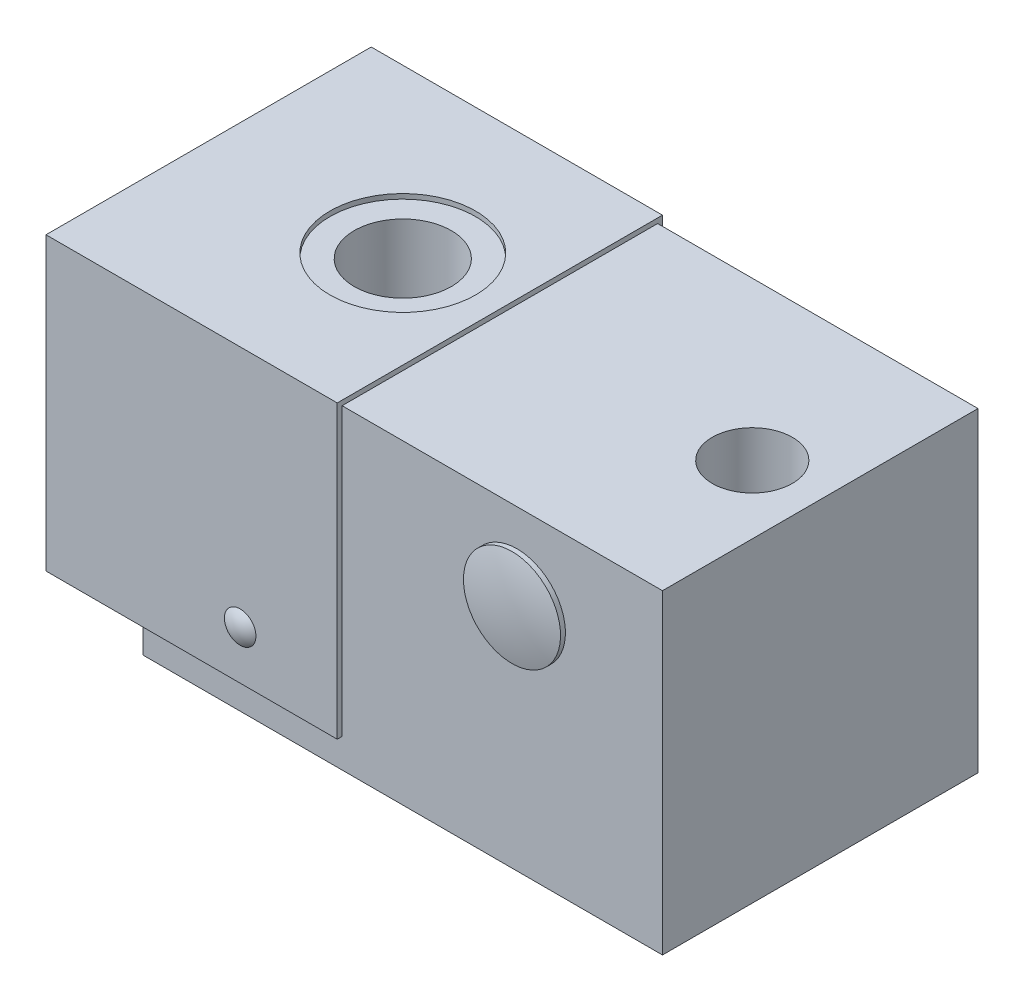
from build123d import *
from build123d.topology import SkipClean

# Parameters (mm, degrees)
EXTRUDE1_DEPTH           = 66
CUT_EXTRUDE1_DEPTH       = 32.5
CUT_EXTRUDE1_DEPTH_BACK  = 32.5
SKETCH2_W                = 66
SKETCH2_H                = 2
CUT_EXTRUDE2_DEPTH       = 32.5
CUT_EXTRUDE2_DEPTH_BACK  = 32.5
SKETCH3_W                = 30
SKETCH3_H                = 65
SKETCH4_W                = 2
SKETCH4_H                = 6
CUT_EXTRUDE3_DEPTH       = 60
SKETCH5_W                = 2
SKETCH5_H                = 6
CUT_EXTRUDE4_DEPTH       = 60
SKETCH7_W                = 8.25
SKETCH7_H                = 65
CUT_EXTRUDE5_DEPTH       = 5
REVOLVE3_ANGLE           = 90
REVOLVE3_OTHER_WAY_ANGLE = 90
REVOLVE4_ANGLE           = 90
REVOLVE4_OTHER_WAY_ANGLE = 90
SKETCH20_R               = 4.55
CUT_EXTRUDE6_DEPTH       = 4.5
CUT_EXTRUDE7_DEPTH       = 5


with BuildPart() as part:
    # Sketch1 → Extrude1 (new body)
    with BuildSketch(Plane(origin=(0, 0, 0), x_dir=(-1, 0, 0), z_dir=(0, 1, 0))):
        Polygon((60, 33.5), (0, 33.5), (0, 32.5), (-66, 32.5), (-66, -32.5), (0, -32.5), (0, -33.5), (60, -33.5), align=None)
    extrude(amount=EXTRUDE1_DEPTH)

    # Sketch2 → Cut-Extrude1 (cut, two sides: drawn at the far end of the back side and taken through both)
    with BuildSketch(Plane.XY.offset(-CUT_EXTRUDE1_DEPTH_BACK)):
        with Locations((33, 66)):
            Rectangle(SKETCH2_W, SKETCH2_H)
    extrude(amount=CUT_EXTRUDE1_DEPTH + CUT_EXTRUDE1_DEPTH_BACK, mode=Mode.SUBTRACT)

    # Sketch3 → Cut-Extrude2 (cut, two sides: drawn at the far end of the back side and taken through both)
    with BuildSketch(Plane.XY.offset(-CUT_EXTRUDE2_DEPTH_BACK)):
        with Locations((-56, 32.5)):
            Rectangle(SKETCH3_W, SKETCH3_H)
    extrude(amount=CUT_EXTRUDE2_DEPTH + CUT_EXTRUDE2_DEPTH_BACK, mode=Mode.SUBTRACT)

    # Sketch4 → Cut-Extrude3 (cut)
    with BuildSketch(Plane(origin=(0, 0, 0), x_dir=(0, 0, -1), z_dir=(1, 0, 0))):
        with Locations((-33.5, 3)):
            Rectangle(SKETCH4_W, SKETCH4_H)
    extrude(amount=-CUT_EXTRUDE3_DEPTH, mode=Mode.SUBTRACT)

    # Sketch5 → Cut-Extrude4 (cut)
    with BuildSketch(Plane(origin=(0, 0, 0), x_dir=(0, 0, -1), z_dir=(1, 0, 0))):
        with Locations((33.5, 3)):
            Rectangle(SKETCH5_W, SKETCH5_H)
    extrude(amount=-CUT_EXTRUDE4_DEPTH, mode=Mode.SUBTRACT)

    # Sketch6 → Cut-Revolve1 (revolve, cut)
    with BuildSketch(Plane.XY, mode=Mode.PRIVATE) as cut_revolve1_sk:
        Polygon((-64.75, 32.5), (-64.75, 50.5), (10, 50.5), (10, 48.75), (33, 48.75), (40.577499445, 32.5), align=None)
    revolve(cut_revolve1_sk.sketch.rotate(Axis((40.577499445, 32.5, 0), (-1, 0, 0)), 270), axis=Axis((40.577499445, 32.5, 0), (-1, 0, 0)), mode=Mode.SUBTRACT)

    # Sketch7 → Cut-Revolve2 (revolve, cut)
    with BuildSketch(Plane.XY, mode=Mode.PRIVATE) as cut_revolve2_sk:
        with Locations((56.125, 32.5)):
            Rectangle(SKETCH7_W, SKETCH7_H)
    revolve(cut_revolve2_sk.sketch.rotate(Axis((52, 0, 0), (0, 1, 0)), 270), axis=Axis((52, 0, 0), (0, 1, 0)), mode=Mode.SUBTRACT)

    # Sketch8 → Cut-Revolve3 (revolve, cut)
    with BuildSketch(Plane.XY.offset(23.5), mode=Mode.PRIVATE) as cut_revolve3_sk:
        Polygon((52, 21.417942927), (56.188, 19), (56.188, 0.812), (57, 0), (52, 0), align=None)
    revolve(cut_revolve3_sk.sketch.rotate(Axis((52, 0, 23.5), (0, 1, 0)), 270), axis=Axis((52, 0, 23.5), (0, 1, 0)), mode=Mode.SUBTRACT)

    # Sketch9 → Cut-Revolve4 (revolve, cut)
    with BuildSketch(Plane.XY.offset(23.5), mode=Mode.PRIVATE) as cut_revolve4_sk:
        Polygon((-31, 21.417942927), (-26.812, 19), (-26.812, 0.812), (-26, 0), (-31, 0), align=None)
    revolve(cut_revolve4_sk.sketch.rotate(Axis((-31, 0, 23.5), (0, 1, 0)), 270), axis=Axis((-31, 0, 23.5), (0, 1, 0)), mode=Mode.SUBTRACT)

    # Sketch10 → Cut-Revolve5 (revolve, cut)
    with BuildSketch(Plane.XY.offset(-23.5), mode=Mode.PRIVATE) as cut_revolve5_sk:
        Polygon((52, 21.417942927), (56.188, 19), (56.188, 0.812), (57, 0), (52, 0), align=None)
    revolve(cut_revolve5_sk.sketch.rotate(Axis((52, 0, -23.5), (0, 1, 0)), 270), axis=Axis((52, 0, -23.5), (0, 1, 0)), mode=Mode.SUBTRACT)

    # Sketch11 → Cut-Revolve6 (revolve, cut)
    with BuildSketch(Plane.XY.offset(-23.5), mode=Mode.PRIVATE) as cut_revolve6_sk:
        Polygon((-31, 21.417942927), (-26.812, 19), (-26.812, 0.812), (-26, 0), (-31, 0), align=None)
    revolve(cut_revolve6_sk.sketch.rotate(Axis((-31, 0, -23.5), (0, 1, 0)), 270), axis=Axis((-31, 0, -23.5), (0, 1, 0)), mode=Mode.SUBTRACT)

    # Sketch12 → Cut-Revolve7 (revolve, cut)
    with BuildSketch(Plane.XY, mode=Mode.PRIVATE) as cut_revolve7_sk:
        Polygon((-20, 66), (-5, 66), (-5, 65), (-10, 65), (-10, 0), (-20, 0), align=None)
    revolve(cut_revolve7_sk.sketch.rotate(Axis((-20, 0, 0), (0, 1, 0)), 270), axis=Axis((-20, 0, 0), (0, 1, 0)), mode=Mode.SUBTRACT)

    # Sketch13 → Cut-Revolve8 (revolve, cut)
    with BuildSketch(Plane(origin=(36, 0, 0), x_dir=(0, 0, -1), z_dir=(1, 0, 0)), mode=Mode.PRIVATE) as cut_revolve8_sk:
        Polygon((32.5, 47.5), (32.5, 40.9215), (31.644, 41.7775), (-31.644, 41.7775), (-32.5, 40.9215), (-32.5, 47.5), align=None)
    revolve(cut_revolve8_sk.sketch.rotate(Axis((36, 47.5, 32.5), (0, 0, -1)), 90), axis=Axis((36, 47.5, 32.5), (0, 0, -1)), mode=Mode.SUBTRACT)

    # Sketch14 → Revolve1 (revolve)
    with BuildSketch(Plane(origin=(36, 0, 0), x_dir=(0, 0, -1), z_dir=(1, 0, 0)), mode=Mode.PRIVATE) as revolve1_sk:
        with BuildLine():
            Line((-22.5, 47.5), (-22.5, 41.7775))
            Line((-22.5, 41.7775), (-32.5, 41.7775))
            Line((-32.5, 41.7775), (-32.5, 37.5))
            Line((-32.5, 37.5), (-33.5, 37.5))
            ThreePointArc((-33.5, 37.5), (-34.451354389, 42.459828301), (-34.770166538, 47.5))
            Line((-34.770166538, 47.5), (-22.5, 47.5))
        make_face()
    revolve(revolve1_sk.sketch.rotate(Axis((36, 47.5, 34.770166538), (0, 0, -1)), 90), axis=Axis((36, 47.5, 34.770166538), (0, 0, -1)))

    # Sketch15 → Revolve2 (revolve)
    with BuildSketch(Plane(origin=(36, 0, 0), x_dir=(0, 0, -1), z_dir=(1, 0, 0)), mode=Mode.PRIVATE) as revolve2_sk:
        Polygon((34.5, 47.5), (34.5, 38.5), (32.5, 38.5), (32.5, 40.9215), (22.5, 40.9215), (22.5, 47.5), align=None)
    revolve(revolve2_sk.sketch.rotate(Axis((36, 47.5, -22.5), (0, 0, -1)), 90), axis=Axis((36, 47.5, -22.5), (0, 0, -1)))

    # Sketch16 → Cut-Extrude5 (cut)
    with BuildSketch(Plane(origin=(0, 0, -34.5), x_dir=(-1, 0, 0), z_dir=(0, 0, -1))):
        Polygon((-33.979274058, 51), (-38.020725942, 51), (-40.041451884, 47.5), (-38.020725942, 44), (-33.979274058, 44), (-31.958548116, 47.5), align=None)
    extrude(amount=-CUT_EXTRUDE5_DEPTH, mode=Mode.SUBTRACT)

    # Sketch17 → Revolve3 (revolve)
    with BuildSketch(Plane(origin=(-20, 0, 0), x_dir=(0, 0, -1), z_dir=(1, 0, 0))):
        with BuildLine():
            Line((-29.7, 21), (-29.7, 11))
            ThreePointArc((-29.7, 11), (-34.7, 16), (-29.7, 21))
        make_face()
    revolve(axis=Axis((-20, 21, 29.7), (0, -1, 0)), revolution_arc=REVOLVE3_ANGLE)

    # Sketch17 → Revolve3 other way (revolve)
    with SkipClean():  # the faces are left unmerged after this step: merging them gives an invalid solid
        with BuildSketch(Plane(origin=(-20, 0, 0), x_dir=(0, 0, -1), z_dir=(1, 0, 0))):
            with BuildLine():
                Line((-29.7, 21), (-29.7, 11))
                ThreePointArc((-29.7, 11), (-34.7, 16), (-29.7, 21))
            make_face()
        revolve(axis=Axis((-20, 21, 29.7), (0, 1, 0)), revolution_arc=REVOLVE3_OTHER_WAY_ANGLE)

    # Sketch18 → Revolve4 (revolve)
    with SkipClean():  # the faces are left unmerged after this step: merging them gives an invalid solid
        with BuildSketch(Plane(origin=(-20, 0, 0), x_dir=(0, 0, -1), z_dir=(1, 0, 0))):
            with BuildLine():
                Line((29.7, 11), (29.7, 21))
                ThreePointArc((29.7, 21), (34.7, 16), (29.7, 11))
            make_face()
        revolve(axis=Axis((-20, 11, -29.7), (0, 1, 0)), revolution_arc=REVOLVE4_ANGLE)

    # Sketch18 → Revolve4 other way (revolve)
    with SkipClean():  # the faces are left unmerged after this step: merging them gives an invalid solid
        with BuildSketch(Plane(origin=(-20, 0, 0), x_dir=(0, 0, -1), z_dir=(1, 0, 0))):
            with BuildLine():
                Line((29.7, 11), (29.7, 21))
                ThreePointArc((29.7, 21), (34.7, 16), (29.7, 11))
            make_face()
        revolve(axis=Axis((-20, 11, -29.7), (0, -1, 0)), revolution_arc=REVOLVE4_OTHER_WAY_ANGLE)

    # Sketch19 → Cut-Revolve9 (revolve, cut)
    with SkipClean():  # the faces are left unmerged after this step: merging them gives an invalid solid
        with BuildSketch(Plane.XY, mode=Mode.PRIVATE) as cut_revolve9_sk:
            Polygon((34.5, 32.5), (36.51, 32.5), (36.51, 2), (41.5, 2), (41.5, 0), (34.5, 0), align=None)
        revolve(cut_revolve9_sk.sketch.rotate(Axis((34.5, 0, 0), (0, 1, 0)), 270), axis=Axis((34.5, 0, 0), (0, 1, 0)), mode=Mode.SUBTRACT)

    # Sketch20 → Cut-Extrude6 (cut)
    with SkipClean():  # the faces are left unmerged after this step: merging them gives an invalid solid
        with BuildSketch(Plane.XZ.offset(-2)):
            with Locations(Location((34.5, 0, 0), (0, 0, 270))):
                Circle(SKETCH20_R)
        extrude(amount=-CUT_EXTRUDE6_DEPTH, mode=Mode.SUBTRACT)

    # Sketch21 → Revolve5 (revolve)
    with SkipClean():  # the faces are left unmerged after this step: merging them gives an invalid solid
        with BuildSketch(Plane.XY, mode=Mode.PRIVATE) as revolve5_sk:
            with BuildLine():
                Line((34.5, 16.5), (36.5, 16.5))
                Line((36.5, 16.5), (37, 16))
                Line((37, 16), (37, 6.5))
                Line((37, 6.5), (38.75, 6.5))
                Line((38.75, 6.5), (38.75, 2))
                ThreePointArc((38.75, 2), (38.603553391, 1.646446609), (38.25, 1.5))
                Line((38.25, 1.5), (34.5, 1.5))
                Line((34.5, 1.5), (34.5, 16.5))
            make_face()
        revolve(revolve5_sk.sketch.rotate(Axis((34.5, 1.5, 0), (0, 1, 0)), 270), axis=Axis((34.5, 1.5, 0), (0, 1, 0)))

    # Sketch22 → Cut-Extrude7 (cut)
    with SkipClean():  # the faces are left unmerged after this step: merging them gives an invalid solid
        with BuildSketch(Plane.XZ.offset(-1.5)):
            Polygon((32, 1.443375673), (32, -1.443375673), (34.5, -2.886751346), (37, -1.443375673), (37, 1.443375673), (34.5, 2.886751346), align=None)
        extrude(amount=-CUT_EXTRUDE7_DEPTH, mode=Mode.SUBTRACT)


solid = part.part
